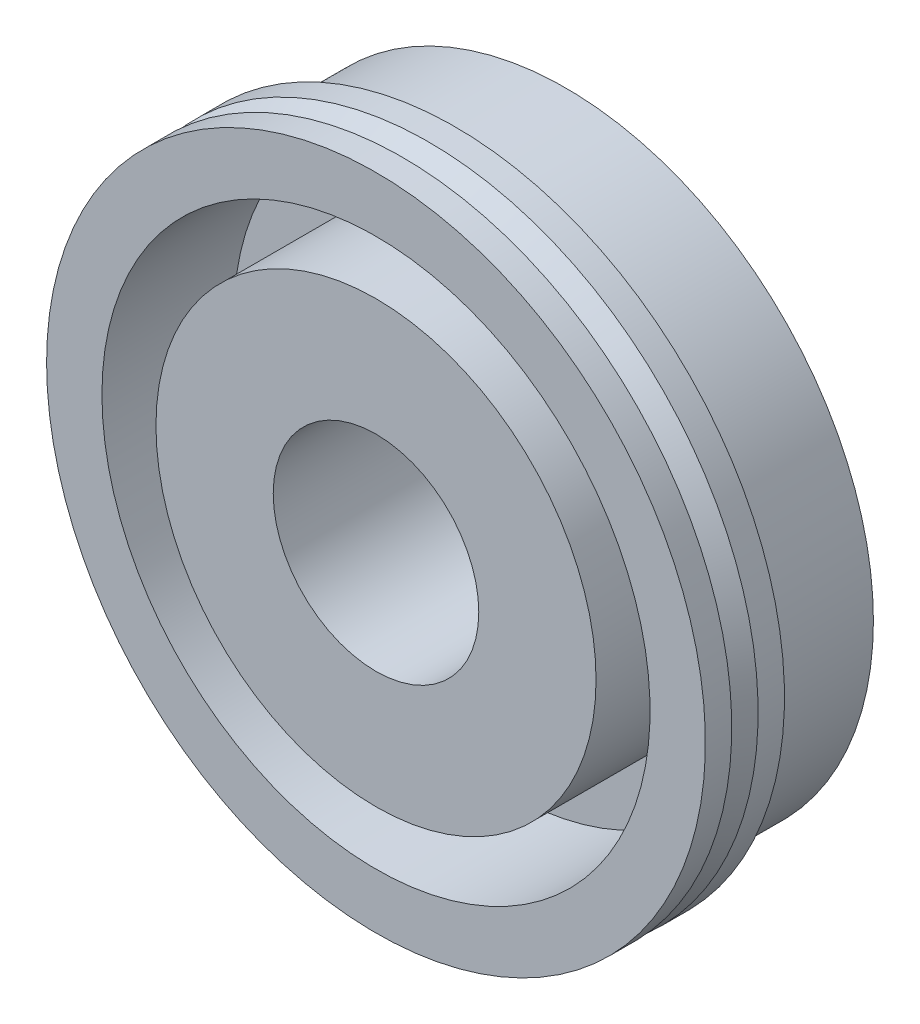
ISO-10303-21;
HEADER;
FILE_DESCRIPTION(('STEP AP214'),'2;1');
FILE_NAME('part.step','',(''),(''),'','','');
FILE_SCHEMA(('AUTOMOTIVE_DESIGN { 1 0 10303 214 1 1 1 1 }'));
ENDSEC;
DATA;
#1=APPLICATION_CONTEXT('core data for automotive mechanical design processes');
#2=APPLICATION_PROTOCOL_DEFINITION('international standard','automotive_design',2000,#1);
#3=PRODUCT_CONTEXT('',#1,'mechanical');
#4=PRODUCT('Part','Part','',(#3));
#5=PRODUCT_RELATED_PRODUCT_CATEGORY('part','',(#4));
#6=PRODUCT_DEFINITION_FORMATION('','',#4);
#7=PRODUCT_DEFINITION_CONTEXT('part definition',#1,'design');
#8=PRODUCT_DEFINITION('design','',#6,#7);
#9=PRODUCT_DEFINITION_SHAPE('','',#8);
#10=(LENGTH_UNIT() NAMED_UNIT(*) SI_UNIT(.MILLI.,.METRE.));
#11=(NAMED_UNIT(*) PLANE_ANGLE_UNIT() SI_UNIT($,.RADIAN.));
#12=(NAMED_UNIT(*) SI_UNIT($,.STERADIAN.) SOLID_ANGLE_UNIT());
#13=UNCERTAINTY_MEASURE_WITH_UNIT(LENGTH_MEASURE(1.E-05),#10,'distance_accuracy_value','');
#14=(GEOMETRIC_REPRESENTATION_CONTEXT(3) GLOBAL_UNCERTAINTY_ASSIGNED_CONTEXT((#13)) GLOBAL_UNIT_ASSIGNED_CONTEXT((#10,
#11,#12)) REPRESENTATION_CONTEXT('',''));
#15=CARTESIAN_POINT('',(0.,0.,0.));
#16=DIRECTION('',(0.,0.,1.));
#17=DIRECTION('',(1.,0.,0.));
#18=AXIS2_PLACEMENT_3D('',#15,#16,#17);
#19=CARTESIAN_POINT('',(0.,0.,0.));
#20=DIRECTION('',(0.,0.,-1.));
#21=DIRECTION('',(-1.,0.,0.));
#22=AXIS2_PLACEMENT_3D('',#19,#20,#21);
#23=CYLINDRICAL_SURFACE('',#22,3.9);
#24=CARTESIAN_POINT('',(0.,0.,-7.20000000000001));
#25=DIRECTION('',(0.,0.,-1.));
#26=DIRECTION('',(-1.,0.,0.));
#27=AXIS2_PLACEMENT_3D('',#24,#25,#26);
#28=CIRCLE('',#27,3.9);
#29=CARTESIAN_POINT('',(-3.9,0.,-7.20000000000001));
#30=VERTEX_POINT('',#29);
#31=EDGE_CURVE('E10',#30,#30,#28,.T.);
#32=ORIENTED_EDGE('',*,*,#31,.T.);
#33=EDGE_LOOP('',(#32));
#34=FACE_BOUND('',#33,.T.);
#35=CARTESIAN_POINT('',(0.,0.,0.));
#36=DIRECTION('',(0.,0.,-1.));
#37=DIRECTION('',(-1.,0.,0.));
#38=AXIS2_PLACEMENT_3D('',#35,#36,#37);
#39=CIRCLE('',#38,3.9);
#40=CARTESIAN_POINT('',(-3.9,0.,0.));
#41=VERTEX_POINT('',#40);
#42=EDGE_CURVE('E72',#41,#41,#39,.T.);
#43=ORIENTED_EDGE('',*,*,#42,.F.);
#44=EDGE_LOOP('',(#43));
#45=FACE_BOUND('',#44,.T.);
#46=ADVANCED_FACE('F29',(#34,#45),#23,.F.);
#47=CARTESIAN_POINT('',(0.,11.675,-7.20000000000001));
#48=DIRECTION('',(0.,0.,-1.));
#49=DIRECTION('',(-1.,0.,0.));
#50=AXIS2_PLACEMENT_3D('',#47,#48,#49);
#51=PLANE('',#50);
#52=CARTESIAN_POINT('',(0.,0.,-7.20000000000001));
#53=DIRECTION('',(0.,0.,-1.));
#54=DIRECTION('',(-1.,0.,0.));
#55=AXIS2_PLACEMENT_3D('',#52,#53,#54);
#56=CIRCLE('',#55,11.675);
#57=CARTESIAN_POINT('',(-11.675,0.,-7.20000000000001));
#58=VERTEX_POINT('',#57);
#59=EDGE_CURVE('E35',#58,#58,#56,.T.);
#60=ORIENTED_EDGE('',*,*,#59,.T.);
#61=EDGE_LOOP('',(#60));
#62=FACE_BOUND('',#61,.T.);
#63=ORIENTED_EDGE('',*,*,#31,.F.);
#64=EDGE_LOOP('',(#63));
#65=FACE_BOUND('',#64,.T.);
#66=ADVANCED_FACE('F80',(#62,#65),#51,.T.);
#67=CARTESIAN_POINT('',(0.,0.,0.));
#68=DIRECTION('',(0.,0.,-1.));
#69=DIRECTION('',(-1.,0.,0.));
#70=AXIS2_PLACEMENT_3D('',#67,#68,#69);
#71=CYLINDRICAL_SURFACE('',#70,11.675);
#72=CARTESIAN_POINT('',(0.,0.,-3.));
#73=DIRECTION('',(0.,0.,-1.));
#74=DIRECTION('',(-1.,0.,0.));
#75=AXIS2_PLACEMENT_3D('',#72,#73,#74);
#76=CIRCLE('',#75,11.675);
#77=CARTESIAN_POINT('',(-11.675,0.,-3.));
#78=VERTEX_POINT('',#77);
#79=EDGE_CURVE('E39',#78,#78,#76,.T.);
#80=ORIENTED_EDGE('',*,*,#79,.T.);
#81=EDGE_LOOP('',(#80));
#82=FACE_BOUND('',#81,.T.);
#83=ORIENTED_EDGE('',*,*,#59,.F.);
#84=EDGE_LOOP('',(#83));
#85=FACE_BOUND('',#84,.T.);
#86=ADVANCED_FACE('F84',(#82,#85),#71,.T.);
#87=CARTESIAN_POINT('',(0.,12.5,-3.));
#88=DIRECTION('',(0.,0.,-1.));
#89=DIRECTION('',(-1.,0.,0.));
#90=AXIS2_PLACEMENT_3D('',#87,#88,#89);
#91=PLANE('',#90);
#92=CARTESIAN_POINT('',(0.,0.,-3.));
#93=DIRECTION('',(0.,0.,-1.));
#94=DIRECTION('',(-1.,0.,0.));
#95=AXIS2_PLACEMENT_3D('',#92,#93,#94);
#96=CIRCLE('',#95,12.5);
#97=CARTESIAN_POINT('',(-12.5,0.,-3.));
#98=VERTEX_POINT('',#97);
#99=EDGE_CURVE('E43',#98,#98,#96,.T.);
#100=ORIENTED_EDGE('',*,*,#99,.T.);
#101=EDGE_LOOP('',(#100));
#102=FACE_BOUND('',#101,.T.);
#103=ORIENTED_EDGE('',*,*,#79,.F.);
#104=EDGE_LOOP('',(#103));
#105=FACE_BOUND('',#104,.T.);
#106=ADVANCED_FACE('F88',(#102,#105),#91,.T.);
#107=CARTESIAN_POINT('',(0.,0.,0.));
#108=DIRECTION('',(0.,0.,-1.));
#109=DIRECTION('',(-1.,0.,0.));
#110=AXIS2_PLACEMENT_3D('',#107,#108,#109);
#111=CYLINDRICAL_SURFACE('',#110,12.5);
#112=CARTESIAN_POINT('',(0.,0.,-2.));
#113=DIRECTION('',(0.,0.,-1.));
#114=DIRECTION('',(-1.,0.,0.));
#115=AXIS2_PLACEMENT_3D('',#112,#113,#114);
#116=CIRCLE('',#115,12.5);
#117=CARTESIAN_POINT('',(-12.5,0.,-2.));
#118=VERTEX_POINT('',#117);
#119=EDGE_CURVE('E48',#118,#118,#116,.T.);
#120=ORIENTED_EDGE('',*,*,#119,.T.);
#121=EDGE_LOOP('',(#120));
#122=FACE_BOUND('',#121,.T.);
#123=ORIENTED_EDGE('',*,*,#99,.F.);
#124=EDGE_LOOP('',(#123));
#125=FACE_BOUND('',#124,.T.);
#126=ADVANCED_FACE('F95',(#122,#125),#111,.T.);
#127=CARTESIAN_POINT('',(0.,0.,-2.));
#128=DIRECTION('',(0.,0.,-1.));
#129=DIRECTION('',(-1.,0.,0.));
#130=AXIS2_PLACEMENT_3D('',#127,#128,#129);
#131=CONICAL_SURFACE('',#130,12.5,0.463647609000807);
#132=CARTESIAN_POINT('',(0.,0.,-1.));
#133=DIRECTION('',(0.,0.,-1.));
#134=DIRECTION('',(-1.,0.,0.));
#135=AXIS2_PLACEMENT_3D('',#132,#133,#134);
#136=CIRCLE('',#135,12.);
#137=CARTESIAN_POINT('',(-12.,0.,-1.));
#138=VERTEX_POINT('',#137);
#139=EDGE_CURVE('E51',#138,#138,#136,.T.);
#140=ORIENTED_EDGE('',*,*,#139,.T.);
#141=EDGE_LOOP('',(#140));
#142=FACE_BOUND('',#141,.T.);
#143=ORIENTED_EDGE('',*,*,#119,.F.);
#144=EDGE_LOOP('',(#143));
#145=FACE_BOUND('',#144,.T.);
#146=ADVANCED_FACE('F99',(#142,#145),#131,.T.);
#147=CARTESIAN_POINT('',(0.,12.5,-1.));
#148=DIRECTION('',(0.,0.,-1.));
#149=DIRECTION('',(-1.,0.,0.));
#150=AXIS2_PLACEMENT_3D('',#147,#148,#149);
#151=PLANE('',#150);
#152=CARTESIAN_POINT('',(0.,0.,-1.));
#153=DIRECTION('',(0.,0.,-1.));
#154=DIRECTION('',(-1.,0.,0.));
#155=AXIS2_PLACEMENT_3D('',#152,#153,#154);
#156=CIRCLE('',#155,12.5);
#157=CARTESIAN_POINT('',(-12.5,0.,-1.));
#158=VERTEX_POINT('',#157);
#159=EDGE_CURVE('E54',#158,#158,#156,.T.);
#160=ORIENTED_EDGE('',*,*,#159,.T.);
#161=EDGE_LOOP('',(#160));
#162=FACE_BOUND('',#161,.T.);
#163=ORIENTED_EDGE('',*,*,#139,.F.);
#164=EDGE_LOOP('',(#163));
#165=FACE_BOUND('',#164,.T.);
#166=ADVANCED_FACE('F103',(#162,#165),#151,.T.);
#167=CARTESIAN_POINT('',(0.,0.,0.));
#168=DIRECTION('',(0.,0.,-1.));
#169=DIRECTION('',(-1.,0.,0.));
#170=AXIS2_PLACEMENT_3D('',#167,#168,#169);
#171=CYLINDRICAL_SURFACE('',#170,12.5);
#172=CARTESIAN_POINT('',(0.,0.,0.));
#173=DIRECTION('',(0.,0.,-1.));
#174=DIRECTION('',(-1.,0.,0.));
#175=AXIS2_PLACEMENT_3D('',#172,#173,#174);
#176=CIRCLE('',#175,12.5);
#177=CARTESIAN_POINT('',(-12.5,0.,0.));
#178=VERTEX_POINT('',#177);
#179=EDGE_CURVE('E57',#178,#178,#176,.T.);
#180=ORIENTED_EDGE('',*,*,#179,.T.);
#181=EDGE_LOOP('',(#180));
#182=FACE_BOUND('',#181,.T.);
#183=ORIENTED_EDGE('',*,*,#159,.F.);
#184=EDGE_LOOP('',(#183));
#185=FACE_BOUND('',#184,.T.);
#186=ADVANCED_FACE('F107',(#182,#185),#171,.T.);
#187=CARTESIAN_POINT('',(0.,10.4,0.));
#188=DIRECTION('',(0.,0.,1.));
#189=DIRECTION('',(1.,0.,0.));
#190=AXIS2_PLACEMENT_3D('',#187,#188,#189);
#191=PLANE('',#190);
#192=CARTESIAN_POINT('',(0.,0.,0.));
#193=DIRECTION('',(0.,0.,-1.));
#194=DIRECTION('',(-1.,0.,0.));
#195=AXIS2_PLACEMENT_3D('',#192,#193,#194);
#196=CIRCLE('',#195,10.4);
#197=CARTESIAN_POINT('',(-10.4,0.,0.));
#198=VERTEX_POINT('',#197);
#199=EDGE_CURVE('E60',#198,#198,#196,.T.);
#200=ORIENTED_EDGE('',*,*,#199,.T.);
#201=EDGE_LOOP('',(#200));
#202=FACE_BOUND('',#201,.T.);
#203=ORIENTED_EDGE('',*,*,#179,.F.);
#204=EDGE_LOOP('',(#203));
#205=FACE_BOUND('',#204,.T.);
#206=ADVANCED_FACE('F111',(#202,#205),#191,.T.);
#207=CARTESIAN_POINT('',(0.,0.,0.));
#208=DIRECTION('',(0.,0.,-1.));
#209=DIRECTION('',(-1.,0.,0.));
#210=AXIS2_PLACEMENT_3D('',#207,#208,#209);
#211=CYLINDRICAL_SURFACE('',#210,10.4);
#212=CARTESIAN_POINT('',(0.,0.,-5.));
#213=DIRECTION('',(0.,0.,-1.));
#214=DIRECTION('',(-1.,0.,0.));
#215=AXIS2_PLACEMENT_3D('',#212,#213,#214);
#216=CIRCLE('',#215,10.4);
#217=CARTESIAN_POINT('',(-10.4,0.,-5.));
#218=VERTEX_POINT('',#217);
#219=EDGE_CURVE('E63',#218,#218,#216,.T.);
#220=ORIENTED_EDGE('',*,*,#219,.T.);
#221=EDGE_LOOP('',(#220));
#222=FACE_BOUND('',#221,.T.);
#223=ORIENTED_EDGE('',*,*,#199,.F.);
#224=EDGE_LOOP('',(#223));
#225=FACE_BOUND('',#224,.T.);
#226=ADVANCED_FACE('F115',(#222,#225),#211,.F.);
#227=CARTESIAN_POINT('',(0.,8.35,-5.));
#228=DIRECTION('',(0.,0.,1.));
#229=DIRECTION('',(1.,0.,0.));
#230=AXIS2_PLACEMENT_3D('',#227,#228,#229);
#231=PLANE('',#230);
#232=CARTESIAN_POINT('',(0.,0.,-5.));
#233=DIRECTION('',(0.,0.,-1.));
#234=DIRECTION('',(-1.,0.,0.));
#235=AXIS2_PLACEMENT_3D('',#232,#233,#234);
#236=CIRCLE('',#235,8.35);
#237=CARTESIAN_POINT('',(-8.35,0.,-5.));
#238=VERTEX_POINT('',#237);
#239=EDGE_CURVE('E66',#238,#238,#236,.T.);
#240=ORIENTED_EDGE('',*,*,#239,.T.);
#241=EDGE_LOOP('',(#240));
#242=FACE_BOUND('',#241,.T.);
#243=ORIENTED_EDGE('',*,*,#219,.F.);
#244=EDGE_LOOP('',(#243));
#245=FACE_BOUND('',#244,.T.);
#246=ADVANCED_FACE('F119',(#242,#245),#231,.T.);
#247=CARTESIAN_POINT('',(0.,0.,0.));
#248=DIRECTION('',(0.,0.,-1.));
#249=DIRECTION('',(-1.,0.,0.));
#250=AXIS2_PLACEMENT_3D('',#247,#248,#249);
#251=CYLINDRICAL_SURFACE('',#250,8.35);
#252=CARTESIAN_POINT('',(0.,0.,0.));
#253=DIRECTION('',(0.,0.,-1.));
#254=DIRECTION('',(-1.,0.,0.));
#255=AXIS2_PLACEMENT_3D('',#252,#253,#254);
#256=CIRCLE('',#255,8.35);
#257=CARTESIAN_POINT('',(-8.35,0.,0.));
#258=VERTEX_POINT('',#257);
#259=EDGE_CURVE('E69',#258,#258,#256,.T.);
#260=ORIENTED_EDGE('',*,*,#259,.T.);
#261=EDGE_LOOP('',(#260));
#262=FACE_BOUND('',#261,.T.);
#263=ORIENTED_EDGE('',*,*,#239,.F.);
#264=EDGE_LOOP('',(#263));
#265=FACE_BOUND('',#264,.T.);
#266=ADVANCED_FACE('F123',(#262,#265),#251,.T.);
#267=CARTESIAN_POINT('',(0.,3.9,0.));
#268=DIRECTION('',(0.,0.,1.));
#269=DIRECTION('',(1.,0.,0.));
#270=AXIS2_PLACEMENT_3D('',#267,#268,#269);
#271=PLANE('',#270);
#272=ORIENTED_EDGE('',*,*,#42,.T.);
#273=EDGE_LOOP('',(#272));
#274=FACE_BOUND('',#273,.T.);
#275=ORIENTED_EDGE('',*,*,#259,.F.);
#276=EDGE_LOOP('',(#275));
#277=FACE_BOUND('',#276,.T.);
#278=ADVANCED_FACE('F76',(#274,#277),#271,.T.);
#279=CLOSED_SHELL('',(#46,#66,#86,#106,#126,#146,#166,#186,#206,#226,#246,#266,#278));
#280=MANIFOLD_SOLID_BREP('B2',#279);
#281=ADVANCED_BREP_SHAPE_REPRESENTATION('',(#18,#280),#14);
#282=SHAPE_DEFINITION_REPRESENTATION(#9,#281);
ENDSEC;
END-ISO-10303-21;
